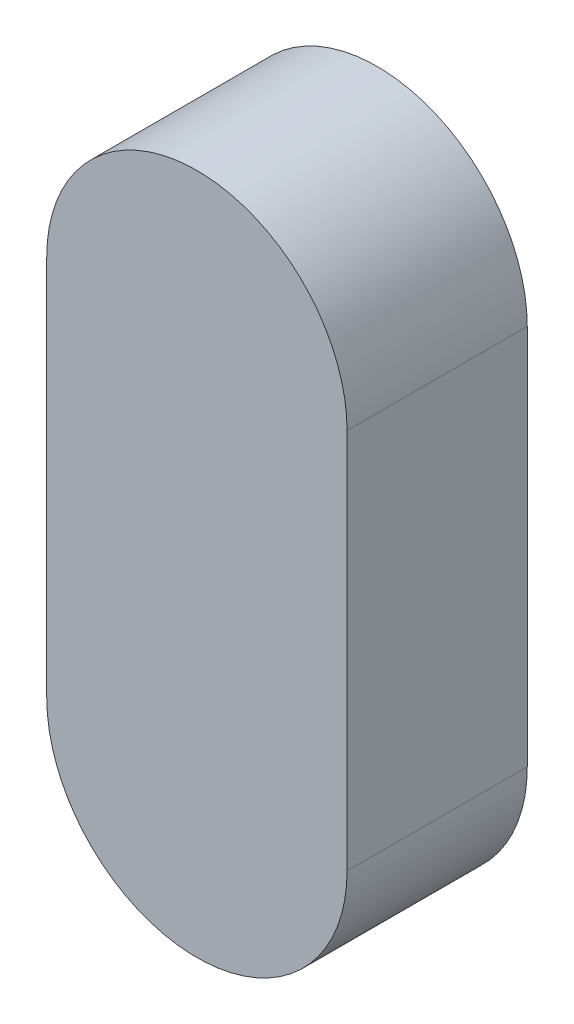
ISO-10303-21;
HEADER;
FILE_DESCRIPTION(('STEP AP214'),'2;1');
FILE_NAME('part.step','',(''),(''),'','','');
FILE_SCHEMA(('AUTOMOTIVE_DESIGN { 1 0 10303 214 1 1 1 1 }'));
ENDSEC;
DATA;
#1=APPLICATION_CONTEXT('core data for automotive mechanical design processes');
#2=APPLICATION_PROTOCOL_DEFINITION('international standard','automotive_design',2000,#1);
#3=PRODUCT_CONTEXT('',#1,'mechanical');
#4=PRODUCT('Part','Part','',(#3));
#5=PRODUCT_RELATED_PRODUCT_CATEGORY('part','',(#4));
#6=PRODUCT_DEFINITION_FORMATION('','',#4);
#7=PRODUCT_DEFINITION_CONTEXT('part definition',#1,'design');
#8=PRODUCT_DEFINITION('design','',#6,#7);
#9=PRODUCT_DEFINITION_SHAPE('','',#8);
#10=(LENGTH_UNIT() NAMED_UNIT(*) SI_UNIT(.MILLI.,.METRE.));
#11=(NAMED_UNIT(*) PLANE_ANGLE_UNIT() SI_UNIT($,.RADIAN.));
#12=(NAMED_UNIT(*) SI_UNIT($,.STERADIAN.) SOLID_ANGLE_UNIT());
#13=UNCERTAINTY_MEASURE_WITH_UNIT(LENGTH_MEASURE(1.E-05),#10,'distance_accuracy_value','');
#14=(GEOMETRIC_REPRESENTATION_CONTEXT(3) GLOBAL_UNCERTAINTY_ASSIGNED_CONTEXT((#13)) GLOBAL_UNIT_ASSIGNED_CONTEXT((#10,
#11,#12)) REPRESENTATION_CONTEXT('',''));
#15=CARTESIAN_POINT('',(0.,0.,0.));
#16=DIRECTION('',(0.,0.,1.));
#17=DIRECTION('',(1.,0.,0.));
#18=AXIS2_PLACEMENT_3D('',#15,#16,#17);
#19=CARTESIAN_POINT('',(0.,0.,12.));
#20=DIRECTION('',(0.,0.,-1.));
#21=DIRECTION('',(-1.,0.,0.));
#22=AXIS2_PLACEMENT_3D('',#19,#20,#21);
#23=CYLINDRICAL_SURFACE('',#22,10.);
#24=CARTESIAN_POINT('',(0.,0.,0.));
#25=DIRECTION('',(0.,0.,1.));
#26=DIRECTION('',(1.,0.,0.));
#27=AXIS2_PLACEMENT_3D('',#24,#25,#26);
#28=CIRCLE('',#27,10.);
#29=CARTESIAN_POINT('',(-10.,0.,0.));
#30=VERTEX_POINT('',#29);
#31=CARTESIAN_POINT('',(10.,0.,0.));
#32=VERTEX_POINT('',#31);
#33=EDGE_CURVE('E99',#30,#32,#28,.T.);
#34=ORIENTED_EDGE('',*,*,#33,.T.);
#35=DIRECTION('',(0.,0.,-1.));
#36=VECTOR('',#35,1.);
#37=CARTESIAN_POINT('',(10.,0.,12.));
#38=LINE('',#37,#36);
#39=CARTESIAN_POINT('',(10.,0.,12.));
#40=VERTEX_POINT('',#39);
#41=EDGE_CURVE('E11',#40,#32,#38,.T.);
#42=ORIENTED_EDGE('',*,*,#41,.F.);
#43=CARTESIAN_POINT('',(0.,0.,12.));
#44=DIRECTION('',(0.,0.,1.));
#45=DIRECTION('',(1.,0.,0.));
#46=AXIS2_PLACEMENT_3D('',#43,#44,#45);
#47=CIRCLE('',#46,10.);
#48=CARTESIAN_POINT('',(-10.,0.,12.));
#49=VERTEX_POINT('',#48);
#50=EDGE_CURVE('E87',#49,#40,#47,.T.);
#51=ORIENTED_EDGE('',*,*,#50,.F.);
#52=DIRECTION('',(0.,0.,-1.));
#53=VECTOR('',#52,1.);
#54=CARTESIAN_POINT('',(-10.,0.,12.));
#55=LINE('',#54,#53);
#56=EDGE_CURVE('E95',#49,#30,#55,.T.);
#57=ORIENTED_EDGE('',*,*,#56,.T.);
#58=EDGE_LOOP('',(#34,#42,#51,#57));
#59=FACE_BOUND('',#58,.T.);
#60=ADVANCED_FACE('F36',(#59),#23,.T.);
#61=CARTESIAN_POINT('',(10.,0.,12.));
#62=DIRECTION('',(-1.,0.,0.));
#63=DIRECTION('',(0.,0.,1.));
#64=AXIS2_PLACEMENT_3D('',#61,#62,#63);
#65=PLANE('',#64);
#66=DIRECTION('',(0.,1.,0.));
#67=VECTOR('',#66,1.);
#68=CARTESIAN_POINT('',(10.,0.,0.));
#69=LINE('',#68,#67);
#70=CARTESIAN_POINT('',(10.,25.4,0.));
#71=VERTEX_POINT('',#70);
#72=EDGE_CURVE('E91',#32,#71,#69,.T.);
#73=ORIENTED_EDGE('',*,*,#72,.T.);
#74=DIRECTION('',(0.,0.,-1.));
#75=VECTOR('',#74,1.);
#76=CARTESIAN_POINT('',(10.,25.4,12.));
#77=LINE('',#76,#75);
#78=CARTESIAN_POINT('',(10.,25.4,12.));
#79=VERTEX_POINT('',#78);
#80=EDGE_CURVE('E44',#79,#71,#77,.T.);
#81=ORIENTED_EDGE('',*,*,#80,.F.);
#82=DIRECTION('',(0.,1.,0.));
#83=VECTOR('',#82,1.);
#84=CARTESIAN_POINT('',(10.,0.,12.));
#85=LINE('',#84,#83);
#86=EDGE_CURVE('E82',#40,#79,#85,.T.);
#87=ORIENTED_EDGE('',*,*,#86,.F.);
#88=ORIENTED_EDGE('',*,*,#41,.T.);
#89=EDGE_LOOP('',(#73,#81,#87,#88));
#90=FACE_BOUND('',#89,.T.);
#91=ADVANCED_FACE('F90',(#90),#65,.F.);
#92=CARTESIAN_POINT('',(0.,25.4,12.));
#93=DIRECTION('',(0.,0.,-1.));
#94=DIRECTION('',(-1.,0.,0.));
#95=AXIS2_PLACEMENT_3D('',#92,#93,#94);
#96=CYLINDRICAL_SURFACE('',#95,10.);
#97=CARTESIAN_POINT('',(0.,25.4,0.));
#98=DIRECTION('',(0.,0.,1.));
#99=DIRECTION('',(1.,0.,0.));
#100=AXIS2_PLACEMENT_3D('',#97,#98,#99);
#101=CIRCLE('',#100,10.);
#102=CARTESIAN_POINT('',(-10.,25.4,0.));
#103=VERTEX_POINT('',#102);
#104=EDGE_CURVE('E69',#71,#103,#101,.T.);
#105=ORIENTED_EDGE('',*,*,#104,.T.);
#106=DIRECTION('',(0.,0.,-1.));
#107=VECTOR('',#106,1.);
#108=CARTESIAN_POINT('',(-10.,25.4,12.));
#109=LINE('',#108,#107);
#110=CARTESIAN_POINT('',(-10.,25.4,12.));
#111=VERTEX_POINT('',#110);
#112=EDGE_CURVE('E92',#111,#103,#109,.T.);
#113=ORIENTED_EDGE('',*,*,#112,.F.);
#114=CARTESIAN_POINT('',(0.,25.4,12.));
#115=DIRECTION('',(0.,0.,1.));
#116=DIRECTION('',(1.,0.,0.));
#117=AXIS2_PLACEMENT_3D('',#114,#115,#116);
#118=CIRCLE('',#117,10.);
#119=EDGE_CURVE('E85',#79,#111,#118,.T.);
#120=ORIENTED_EDGE('',*,*,#119,.F.);
#121=ORIENTED_EDGE('',*,*,#80,.T.);
#122=EDGE_LOOP('',(#105,#113,#120,#121));
#123=FACE_BOUND('',#122,.T.);
#124=ADVANCED_FACE('F93',(#123),#96,.T.);
#125=CARTESIAN_POINT('',(-10.,0.,12.));
#126=DIRECTION('',(1.,0.,0.));
#127=DIRECTION('',(0.,0.,-1.));
#128=AXIS2_PLACEMENT_3D('',#125,#126,#127);
#129=PLANE('',#128);
#130=DIRECTION('',(0.,-1.,0.));
#131=VECTOR('',#130,1.);
#132=CARTESIAN_POINT('',(-10.,0.,0.));
#133=LINE('',#132,#131);
#134=EDGE_CURVE('E75',#103,#30,#133,.T.);
#135=ORIENTED_EDGE('',*,*,#134,.T.);
#136=ORIENTED_EDGE('',*,*,#56,.F.);
#137=DIRECTION('',(0.,-1.,0.));
#138=VECTOR('',#137,1.);
#139=CARTESIAN_POINT('',(-10.,0.,12.));
#140=LINE('',#139,#138);
#141=EDGE_CURVE('E52',#111,#49,#140,.T.);
#142=ORIENTED_EDGE('',*,*,#141,.F.);
#143=ORIENTED_EDGE('',*,*,#112,.T.);
#144=EDGE_LOOP('',(#135,#136,#142,#143));
#145=FACE_BOUND('',#144,.T.);
#146=ADVANCED_FACE('F106',(#145),#129,.F.);
#147=CARTESIAN_POINT('',(0.,0.,12.));
#148=DIRECTION('',(0.,0.,1.));
#149=DIRECTION('',(1.,0.,0.));
#150=AXIS2_PLACEMENT_3D('',#147,#148,#149);
#151=PLANE('',#150);
#152=ORIENTED_EDGE('',*,*,#50,.T.);
#153=ORIENTED_EDGE('',*,*,#86,.T.);
#154=ORIENTED_EDGE('',*,*,#119,.T.);
#155=ORIENTED_EDGE('',*,*,#141,.T.);
#156=EDGE_LOOP('',(#152,#153,#154,#155));
#157=FACE_BOUND('',#156,.T.);
#158=ADVANCED_FACE('F83',(#157),#151,.T.);
#159=CARTESIAN_POINT('',(0.,0.,0.));
#160=DIRECTION('',(0.,0.,1.));
#161=DIRECTION('',(1.,0.,0.));
#162=AXIS2_PLACEMENT_3D('',#159,#160,#161);
#163=PLANE('',#162);
#164=ORIENTED_EDGE('',*,*,#33,.F.);
#165=ORIENTED_EDGE('',*,*,#134,.F.);
#166=ORIENTED_EDGE('',*,*,#104,.F.);
#167=ORIENTED_EDGE('',*,*,#72,.F.);
#168=EDGE_LOOP('',(#164,#165,#166,#167));
#169=FACE_BOUND('',#168,.T.);
#170=ADVANCED_FACE('F109',(#169),#163,.F.);
#171=CLOSED_SHELL('',(#60,#91,#124,#146,#158,#170));
#172=MANIFOLD_SOLID_BREP('B2',#171);
#173=ADVANCED_BREP_SHAPE_REPRESENTATION('',(#18,#172),#14);
#174=SHAPE_DEFINITION_REPRESENTATION(#9,#173);
ENDSEC;
END-ISO-10303-21;
